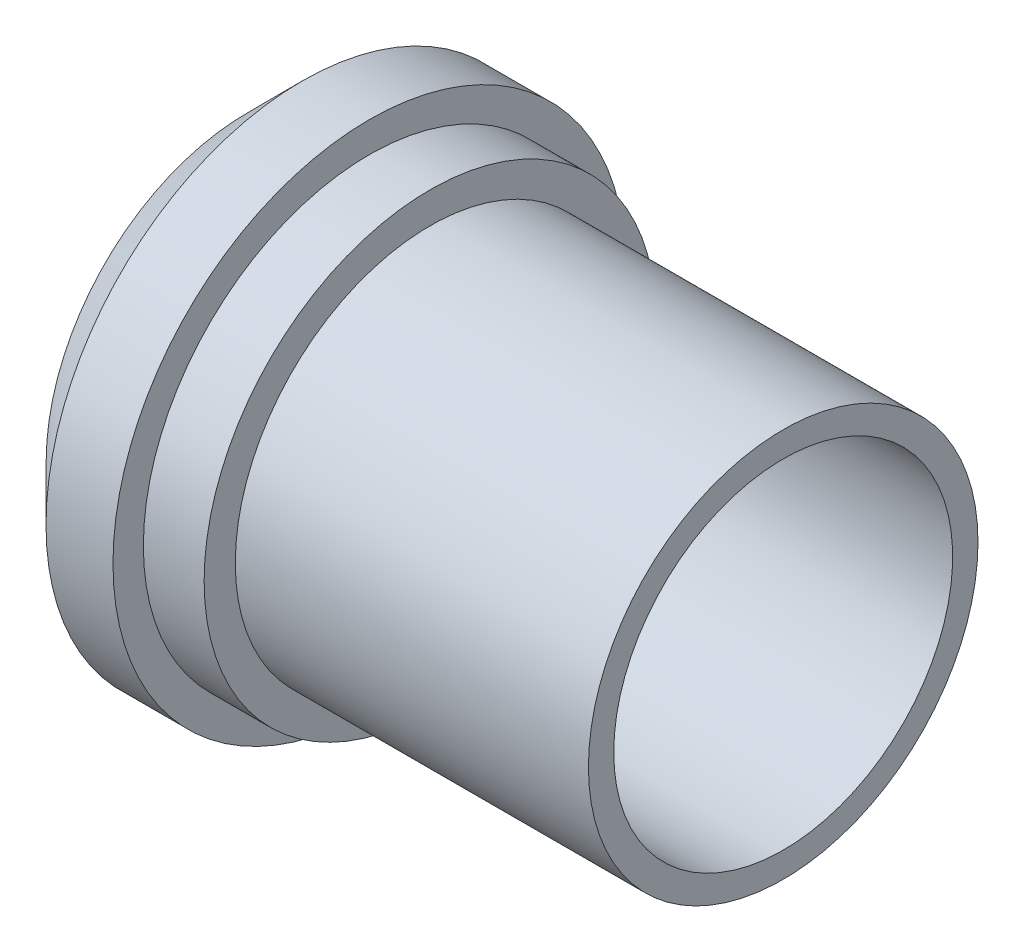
ISO-10303-21;
HEADER;
FILE_DESCRIPTION(('STEP AP214'),'2;1');
FILE_NAME('part.step','',(''),(''),'','','');
FILE_SCHEMA(('AUTOMOTIVE_DESIGN { 1 0 10303 214 1 1 1 1 }'));
ENDSEC;
DATA;
#1=APPLICATION_CONTEXT('core data for automotive mechanical design processes');
#2=APPLICATION_PROTOCOL_DEFINITION('international standard','automotive_design',2000,#1);
#3=PRODUCT_CONTEXT('',#1,'mechanical');
#4=PRODUCT('Part','Part','',(#3));
#5=PRODUCT_RELATED_PRODUCT_CATEGORY('part','',(#4));
#6=PRODUCT_DEFINITION_FORMATION('','',#4);
#7=PRODUCT_DEFINITION_CONTEXT('part definition',#1,'design');
#8=PRODUCT_DEFINITION('design','',#6,#7);
#9=PRODUCT_DEFINITION_SHAPE('','',#8);
#10=(LENGTH_UNIT() NAMED_UNIT(*) SI_UNIT(.MILLI.,.METRE.));
#11=(NAMED_UNIT(*) PLANE_ANGLE_UNIT() SI_UNIT($,.RADIAN.));
#12=(NAMED_UNIT(*) SI_UNIT($,.STERADIAN.) SOLID_ANGLE_UNIT());
#13=UNCERTAINTY_MEASURE_WITH_UNIT(LENGTH_MEASURE(1.E-05),#10,'distance_accuracy_value','');
#14=(GEOMETRIC_REPRESENTATION_CONTEXT(3) GLOBAL_UNCERTAINTY_ASSIGNED_CONTEXT((#13)) GLOBAL_UNIT_ASSIGNED_CONTEXT((#10,
#11,#12)) REPRESENTATION_CONTEXT('',''));
#15=CARTESIAN_POINT('',(0.,0.,0.));
#16=DIRECTION('',(0.,0.,1.));
#17=DIRECTION('',(1.,0.,0.));
#18=AXIS2_PLACEMENT_3D('',#15,#16,#17);
#19=CARTESIAN_POINT('',(0.,12.7,0.));
#20=DIRECTION('',(1.,0.,0.));
#21=DIRECTION('',(0.,0.,-1.));
#22=AXIS2_PLACEMENT_3D('',#19,#20,#21);
#23=PLANE('',#22);
#24=CARTESIAN_POINT('',(0.,12.7,0.));
#25=DIRECTION('',(-1.,0.,0.));
#26=DIRECTION('',(0.,0.,1.));
#27=AXIS2_PLACEMENT_3D('',#24,#25,#26);
#28=CIRCLE('',#27,11.049);
#29=CARTESIAN_POINT('',(0.,12.7,11.049));
#30=VERTEX_POINT('',#29);
#31=EDGE_CURVE('E59',#30,#30,#28,.T.);
#32=ORIENTED_EDGE('',*,*,#31,.T.);
#33=EDGE_LOOP('',(#32));
#34=FACE_BOUND('',#33,.T.);
#35=CARTESIAN_POINT('',(0.,12.7,0.));
#36=DIRECTION('',(-1.,0.,0.));
#37=DIRECTION('',(0.,0.,1.));
#38=AXIS2_PLACEMENT_3D('',#35,#36,#37);
#39=CIRCLE('',#38,12.7);
#40=CARTESIAN_POINT('',(0.,12.7,12.7));
#41=VERTEX_POINT('',#40);
#42=EDGE_CURVE('E10',#41,#41,#39,.T.);
#43=ORIENTED_EDGE('',*,*,#42,.F.);
#44=EDGE_LOOP('',(#43));
#45=FACE_BOUND('',#44,.T.);
#46=ADVANCED_FACE('F31',(#34,#45),#23,.T.);
#47=CARTESIAN_POINT('',(-34.925,12.7,0.));
#48=DIRECTION('',(-1.,0.,0.));
#49=DIRECTION('',(0.,0.,1.));
#50=AXIS2_PLACEMENT_3D('',#47,#48,#49);
#51=CYLINDRICAL_SURFACE('',#50,12.7);
#52=ORIENTED_EDGE('',*,*,#42,.T.);
#53=EDGE_LOOP('',(#52));
#54=FACE_BOUND('',#53,.T.);
#55=CARTESIAN_POINT('',(-23.0251,12.7,0.));
#56=DIRECTION('',(-1.,0.,0.));
#57=DIRECTION('',(0.,0.,1.));
#58=AXIS2_PLACEMENT_3D('',#55,#56,#57);
#59=CIRCLE('',#58,12.7);
#60=CARTESIAN_POINT('',(-23.0251,12.7,12.7));
#61=VERTEX_POINT('',#60);
#62=EDGE_CURVE('E37',#61,#61,#59,.T.);
#63=ORIENTED_EDGE('',*,*,#62,.F.);
#64=EDGE_LOOP('',(#63));
#65=FACE_BOUND('',#64,.T.);
#66=ADVANCED_FACE('F92',(#54,#65),#51,.T.);
#67=CARTESIAN_POINT('',(-23.0251,0.,0.));
#68=DIRECTION('',(1.,0.,0.));
#69=DIRECTION('',(0.,0.,-1.));
#70=AXIS2_PLACEMENT_3D('',#67,#68,#69);
#71=PLANE('',#70);
#72=ORIENTED_EDGE('',*,*,#62,.T.);
#73=EDGE_LOOP('',(#72));
#74=FACE_BOUND('',#73,.T.);
#75=CARTESIAN_POINT('',(-23.0251,12.7,0.));
#76=DIRECTION('',(-1.,0.,0.));
#77=DIRECTION('',(0.,0.,1.));
#78=AXIS2_PLACEMENT_3D('',#75,#76,#77);
#79=CIRCLE('',#78,14.732);
#80=CARTESIAN_POINT('',(-23.0251,12.7,14.732));
#81=VERTEX_POINT('',#80);
#82=EDGE_CURVE('E41',#81,#81,#79,.T.);
#83=ORIENTED_EDGE('',*,*,#82,.F.);
#84=EDGE_LOOP('',(#83));
#85=FACE_BOUND('',#84,.T.);
#86=ADVANCED_FACE('F96',(#74,#85),#71,.T.);
#87=CARTESIAN_POINT('',(-34.925,12.7,0.));
#88=DIRECTION('',(-1.,0.,0.));
#89=DIRECTION('',(0.,0.,1.));
#90=AXIS2_PLACEMENT_3D('',#87,#88,#89);
#91=CYLINDRICAL_SURFACE('',#90,14.732);
#92=ORIENTED_EDGE('',*,*,#82,.T.);
#93=EDGE_LOOP('',(#92));
#94=FACE_BOUND('',#93,.T.);
#95=CARTESIAN_POINT('',(-26.9875,12.7,0.));
#96=DIRECTION('',(-1.,0.,0.));
#97=DIRECTION('',(0.,0.,1.));
#98=AXIS2_PLACEMENT_3D('',#95,#96,#97);
#99=CIRCLE('',#98,14.732);
#100=CARTESIAN_POINT('',(-26.9875,12.7,14.732));
#101=VERTEX_POINT('',#100);
#102=EDGE_CURVE('E45',#101,#101,#99,.T.);
#103=ORIENTED_EDGE('',*,*,#102,.F.);
#104=EDGE_LOOP('',(#103));
#105=FACE_BOUND('',#104,.T.);
#106=ADVANCED_FACE('F100',(#94,#105),#91,.T.);
#107=CARTESIAN_POINT('',(-26.9875,-2.032,0.));
#108=DIRECTION('',(1.,0.,0.));
#109=DIRECTION('',(0.,0.,-1.));
#110=AXIS2_PLACEMENT_3D('',#107,#108,#109);
#111=PLANE('',#110);
#112=ORIENTED_EDGE('',*,*,#102,.T.);
#113=EDGE_LOOP('',(#112));
#114=FACE_BOUND('',#113,.T.);
#115=CARTESIAN_POINT('',(-26.9875,12.7,0.));
#116=DIRECTION('',(-1.,0.,0.));
#117=DIRECTION('',(0.,0.,1.));
#118=AXIS2_PLACEMENT_3D('',#115,#116,#117);
#119=CIRCLE('',#118,16.7132);
#120=CARTESIAN_POINT('',(-26.9875,12.7,16.7132));
#121=VERTEX_POINT('',#120);
#122=EDGE_CURVE('E50',#121,#121,#119,.T.);
#123=ORIENTED_EDGE('',*,*,#122,.F.);
#124=EDGE_LOOP('',(#123));
#125=FACE_BOUND('',#124,.T.);
#126=ADVANCED_FACE('F88',(#114,#125),#111,.T.);
#127=CARTESIAN_POINT('',(-34.925,12.7,0.));
#128=DIRECTION('',(-1.,0.,0.));
#129=DIRECTION('',(0.,0.,1.));
#130=AXIS2_PLACEMENT_3D('',#127,#128,#129);
#131=CYLINDRICAL_SURFACE('',#130,16.7132);
#132=ORIENTED_EDGE('',*,*,#122,.T.);
#133=EDGE_LOOP('',(#132));
#134=FACE_BOUND('',#133,.T.);
#135=CARTESIAN_POINT('',(-31.35376,12.7,0.));
#136=DIRECTION('',(-1.,0.,0.));
#137=DIRECTION('',(0.,0.,1.));
#138=AXIS2_PLACEMENT_3D('',#135,#136,#137);
#139=CIRCLE('',#138,16.7132);
#140=CARTESIAN_POINT('',(-31.35376,12.7,16.7132));
#141=VERTEX_POINT('',#140);
#142=EDGE_CURVE('E53',#141,#141,#139,.T.);
#143=ORIENTED_EDGE('',*,*,#142,.F.);
#144=EDGE_LOOP('',(#143));
#145=FACE_BOUND('',#144,.T.);
#146=ADVANCED_FACE('F82',(#134,#145),#131,.T.);
#147=CARTESIAN_POINT('',(-34.925,12.7,0.));
#148=DIRECTION('',(1.,0.,0.));
#149=DIRECTION('',(0.,0.,-1.));
#150=AXIS2_PLACEMENT_3D('',#147,#148,#149);
#151=CONICAL_SURFACE('',#150,13.1318,0.786818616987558);
#152=ORIENTED_EDGE('',*,*,#142,.T.);
#153=EDGE_LOOP('',(#152));
#154=FACE_BOUND('',#153,.T.);
#155=CARTESIAN_POINT('',(-34.925,12.7,0.));
#156=DIRECTION('',(-1.,0.,0.));
#157=DIRECTION('',(0.,0.,1.));
#158=AXIS2_PLACEMENT_3D('',#155,#156,#157);
#159=CIRCLE('',#158,13.1318);
#160=CARTESIAN_POINT('',(-34.925,12.7,13.1318));
#161=VERTEX_POINT('',#160);
#162=EDGE_CURVE('E56',#161,#161,#159,.T.);
#163=ORIENTED_EDGE('',*,*,#162,.F.);
#164=EDGE_LOOP('',(#163));
#165=FACE_BOUND('',#164,.T.);
#166=ADVANCED_FACE('F77',(#154,#165),#151,.T.);
#167=CARTESIAN_POINT('',(-34.925,-0.431800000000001,0.));
#168=DIRECTION('',(-1.,0.,0.));
#169=DIRECTION('',(0.,0.,1.));
#170=AXIS2_PLACEMENT_3D('',#167,#168,#169);
#171=PLANE('',#170);
#172=CARTESIAN_POINT('',(-34.925,12.7,0.));
#173=DIRECTION('',(-1.,0.,0.));
#174=DIRECTION('',(0.,0.,1.));
#175=AXIS2_PLACEMENT_3D('',#172,#173,#174);
#176=CIRCLE('',#175,11.049);
#177=CARTESIAN_POINT('',(-34.925,12.7,11.049));
#178=VERTEX_POINT('',#177);
#179=EDGE_CURVE('E60',#178,#178,#176,.T.);
#180=ORIENTED_EDGE('',*,*,#179,.F.);
#181=EDGE_LOOP('',(#180));
#182=FACE_BOUND('',#181,.T.);
#183=ORIENTED_EDGE('',*,*,#162,.T.);
#184=EDGE_LOOP('',(#183));
#185=FACE_BOUND('',#184,.T.);
#186=ADVANCED_FACE('F71',(#182,#185),#171,.T.);
#187=CARTESIAN_POINT('',(0.,12.7,0.));
#188=DIRECTION('',(-1.,0.,0.));
#189=DIRECTION('',(0.,0.,1.));
#190=AXIS2_PLACEMENT_3D('',#187,#188,#189);
#191=CYLINDRICAL_SURFACE('',#190,11.049);
#192=ORIENTED_EDGE('',*,*,#31,.F.);
#193=EDGE_LOOP('',(#192));
#194=FACE_BOUND('',#193,.T.);
#195=ORIENTED_EDGE('',*,*,#179,.T.);
#196=EDGE_LOOP('',(#195));
#197=FACE_BOUND('',#196,.T.);
#198=ADVANCED_FACE('F68',(#194,#197),#191,.F.);
#199=CLOSED_SHELL('',(#46,#66,#86,#106,#126,#146,#166,#186,#198));
#200=MANIFOLD_SOLID_BREP('B2',#199);
#201=ADVANCED_BREP_SHAPE_REPRESENTATION('',(#18,#200),#14);
#202=SHAPE_DEFINITION_REPRESENTATION(#9,#201);
ENDSEC;
END-ISO-10303-21;
